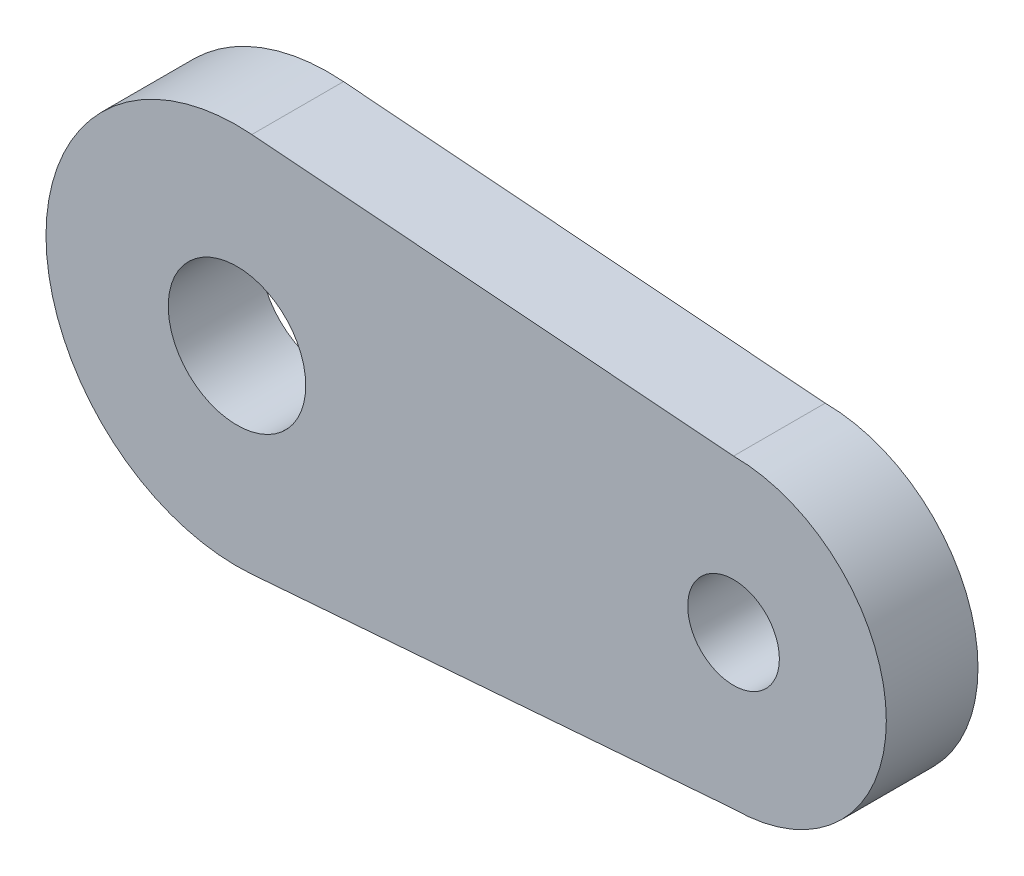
ISO-10303-21;
HEADER;
FILE_DESCRIPTION(('STEP AP214'),'2;1');
FILE_NAME('part.step','',(''),(''),'','','');
FILE_SCHEMA(('AUTOMOTIVE_DESIGN { 1 0 10303 214 1 1 1 1 }'));
ENDSEC;
DATA;
#1=APPLICATION_CONTEXT('core data for automotive mechanical design processes');
#2=APPLICATION_PROTOCOL_DEFINITION('international standard','automotive_design',2000,#1);
#3=PRODUCT_CONTEXT('',#1,'mechanical');
#4=PRODUCT('Part','Part','',(#3));
#5=PRODUCT_RELATED_PRODUCT_CATEGORY('part','',(#4));
#6=PRODUCT_DEFINITION_FORMATION('','',#4);
#7=PRODUCT_DEFINITION_CONTEXT('part definition',#1,'design');
#8=PRODUCT_DEFINITION('design','',#6,#7);
#9=PRODUCT_DEFINITION_SHAPE('','',#8);
#10=(LENGTH_UNIT() NAMED_UNIT(*) SI_UNIT(.MILLI.,.METRE.));
#11=(NAMED_UNIT(*) PLANE_ANGLE_UNIT() SI_UNIT($,.RADIAN.));
#12=(NAMED_UNIT(*) SI_UNIT($,.STERADIAN.) SOLID_ANGLE_UNIT());
#13=UNCERTAINTY_MEASURE_WITH_UNIT(LENGTH_MEASURE(1.E-05),#10,'distance_accuracy_value','');
#14=(GEOMETRIC_REPRESENTATION_CONTEXT(3) GLOBAL_UNCERTAINTY_ASSIGNED_CONTEXT((#13)) GLOBAL_UNIT_ASSIGNED_CONTEXT((#10,
#11,#12)) REPRESENTATION_CONTEXT('',''));
#15=CARTESIAN_POINT('',(0.,0.,0.));
#16=DIRECTION('',(0.,0.,1.));
#17=DIRECTION('',(1.,0.,0.));
#18=AXIS2_PLACEMENT_3D('',#15,#16,#17);
#19=CARTESIAN_POINT('',(65.,0.,12.));
#20=DIRECTION('',(0.,0.,1.));
#21=DIRECTION('',(1.,0.,0.));
#22=AXIS2_PLACEMENT_3D('',#19,#20,#21);
#23=PLANE('',#22);
#24=CARTESIAN_POINT('',(0.,0.,12.));
#25=DIRECTION('',(0.,0.,1.));
#26=DIRECTION('',(1.,0.,0.));
#27=AXIS2_PLACEMENT_3D('',#24,#25,#26);
#28=CIRCLE('',#27,9.);
#29=CARTESIAN_POINT('',(9.,0.,12.));
#30=VERTEX_POINT('',#29);
#31=EDGE_CURVE('E103',#30,#30,#28,.T.);
#32=ORIENTED_EDGE('',*,*,#31,.F.);
#33=EDGE_LOOP('',(#32));
#34=FACE_BOUND('',#33,.T.);
#35=CARTESIAN_POINT('',(65.,0.,12.));
#36=DIRECTION('',(0.,0.,1.));
#37=DIRECTION('',(1.,0.,0.));
#38=AXIS2_PLACEMENT_3D('',#35,#36,#37);
#39=CIRCLE('',#38,20.);
#40=CARTESIAN_POINT('',(65.,-20.,12.));
#41=VERTEX_POINT('',#40);
#42=CARTESIAN_POINT('',(65.,20.,12.));
#43=VERTEX_POINT('',#42);
#44=EDGE_CURVE('E88',#41,#43,#39,.T.);
#45=ORIENTED_EDGE('',*,*,#44,.T.);
#46=DIRECTION('',(-0.996964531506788,0.0778570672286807,0.));
#47=VECTOR('',#46,1.);
#48=CARTESIAN_POINT('',(1.94642668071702,24.9241132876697,12.));
#49=LINE('',#48,#47);
#50=CARTESIAN_POINT('',(1.94642668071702,24.9241132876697,12.));
#51=VERTEX_POINT('',#50);
#52=EDGE_CURVE('E83',#43,#51,#49,.T.);
#53=ORIENTED_EDGE('',*,*,#52,.T.);
#54=CARTESIAN_POINT('',(0.,0.,12.));
#55=DIRECTION('',(0.,0.,1.));
#56=DIRECTION('',(1.,0.,0.));
#57=AXIS2_PLACEMENT_3D('',#54,#55,#56);
#58=CIRCLE('',#57,25.);
#59=CARTESIAN_POINT('',(1.94642668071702,-24.9241132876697,12.));
#60=VERTEX_POINT('',#59);
#61=EDGE_CURVE('E86',#51,#60,#58,.T.);
#62=ORIENTED_EDGE('',*,*,#61,.T.);
#63=DIRECTION('',(0.996964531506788,0.0778570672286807,0.));
#64=VECTOR('',#63,1.);
#65=CARTESIAN_POINT('',(1.94642668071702,-24.9241132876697,12.));
#66=LINE('',#65,#64);
#67=EDGE_CURVE('E53',#60,#41,#66,.T.);
#68=ORIENTED_EDGE('',*,*,#67,.T.);
#69=EDGE_LOOP('',(#45,#53,#62,#68));
#70=FACE_BOUND('',#69,.T.);
#71=CARTESIAN_POINT('',(65.,0.,12.));
#72=DIRECTION('',(0.,0.,1.));
#73=DIRECTION('',(1.,0.,0.));
#74=AXIS2_PLACEMENT_3D('',#71,#72,#73);
#75=CIRCLE('',#74,6.);
#76=CARTESIAN_POINT('',(71.,0.,12.));
#77=VERTEX_POINT('',#76);
#78=EDGE_CURVE('E118',#77,#77,#75,.T.);
#79=ORIENTED_EDGE('',*,*,#78,.F.);
#80=EDGE_LOOP('',(#79));
#81=FACE_BOUND('',#80,.T.);
#82=ADVANCED_FACE('F36',(#34,#70,#81),#23,.T.);
#83=CARTESIAN_POINT('',(65.,0.,0.));
#84=DIRECTION('',(0.,0.,1.));
#85=DIRECTION('',(1.,0.,0.));
#86=AXIS2_PLACEMENT_3D('',#83,#84,#85);
#87=PLANE('',#86);
#88=CARTESIAN_POINT('',(65.,0.,0.));
#89=DIRECTION('',(0.,0.,1.));
#90=DIRECTION('',(1.,0.,0.));
#91=AXIS2_PLACEMENT_3D('',#88,#89,#90);
#92=CIRCLE('',#91,20.);
#93=CARTESIAN_POINT('',(65.,-20.,0.));
#94=VERTEX_POINT('',#93);
#95=CARTESIAN_POINT('',(65.,20.,0.));
#96=VERTEX_POINT('',#95);
#97=EDGE_CURVE('E100',#94,#96,#92,.T.);
#98=ORIENTED_EDGE('',*,*,#97,.F.);
#99=DIRECTION('',(0.996964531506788,0.0778570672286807,0.));
#100=VECTOR('',#99,1.);
#101=CARTESIAN_POINT('',(1.94642668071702,-24.9241132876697,0.));
#102=LINE('',#101,#100);
#103=CARTESIAN_POINT('',(1.94642668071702,-24.9241132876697,0.));
#104=VERTEX_POINT('',#103);
#105=EDGE_CURVE('E76',#104,#94,#102,.T.);
#106=ORIENTED_EDGE('',*,*,#105,.F.);
#107=CARTESIAN_POINT('',(0.,0.,0.));
#108=DIRECTION('',(0.,0.,1.));
#109=DIRECTION('',(1.,0.,0.));
#110=AXIS2_PLACEMENT_3D('',#107,#108,#109);
#111=CIRCLE('',#110,25.);
#112=CARTESIAN_POINT('',(1.94642668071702,24.9241132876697,0.));
#113=VERTEX_POINT('',#112);
#114=EDGE_CURVE('E70',#113,#104,#111,.T.);
#115=ORIENTED_EDGE('',*,*,#114,.F.);
#116=DIRECTION('',(-0.996964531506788,0.0778570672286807,0.));
#117=VECTOR('',#116,1.);
#118=CARTESIAN_POINT('',(1.94642668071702,24.9241132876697,0.));
#119=LINE('',#118,#117);
#120=EDGE_CURVE('E92',#96,#113,#119,.T.);
#121=ORIENTED_EDGE('',*,*,#120,.F.);
#122=EDGE_LOOP('',(#98,#106,#115,#121));
#123=FACE_BOUND('',#122,.T.);
#124=CARTESIAN_POINT('',(0.,0.,0.));
#125=DIRECTION('',(0.,0.,1.));
#126=DIRECTION('',(1.,0.,0.));
#127=AXIS2_PLACEMENT_3D('',#124,#125,#126);
#128=CIRCLE('',#127,9.);
#129=CARTESIAN_POINT('',(9.,0.,0.));
#130=VERTEX_POINT('',#129);
#131=EDGE_CURVE('E115',#130,#130,#128,.T.);
#132=ORIENTED_EDGE('',*,*,#131,.T.);
#133=EDGE_LOOP('',(#132));
#134=FACE_BOUND('',#133,.T.);
#135=CARTESIAN_POINT('',(65.,0.,0.));
#136=DIRECTION('',(0.,0.,1.));
#137=DIRECTION('',(1.,0.,0.));
#138=AXIS2_PLACEMENT_3D('',#135,#136,#137);
#139=CIRCLE('',#138,6.);
#140=CARTESIAN_POINT('',(71.,0.,0.));
#141=VERTEX_POINT('',#140);
#142=EDGE_CURVE('E121',#141,#141,#139,.T.);
#143=ORIENTED_EDGE('',*,*,#142,.T.);
#144=EDGE_LOOP('',(#143));
#145=FACE_BOUND('',#144,.T.);
#146=ADVANCED_FACE('F111',(#123,#134,#145),#87,.F.);
#147=CARTESIAN_POINT('',(65.,0.,12.));
#148=DIRECTION('',(0.,0.,-1.));
#149=DIRECTION('',(-1.,0.,0.));
#150=AXIS2_PLACEMENT_3D('',#147,#148,#149);
#151=CYLINDRICAL_SURFACE('',#150,20.);
#152=ORIENTED_EDGE('',*,*,#97,.T.);
#153=DIRECTION('',(0.,0.,-1.));
#154=VECTOR('',#153,1.);
#155=CARTESIAN_POINT('',(65.,20.,12.));
#156=LINE('',#155,#154);
#157=EDGE_CURVE('E11',#43,#96,#156,.T.);
#158=ORIENTED_EDGE('',*,*,#157,.F.);
#159=ORIENTED_EDGE('',*,*,#44,.F.);
#160=DIRECTION('',(0.,0.,-1.));
#161=VECTOR('',#160,1.);
#162=CARTESIAN_POINT('',(65.,-20.,12.));
#163=LINE('',#162,#161);
#164=EDGE_CURVE('E96',#41,#94,#163,.T.);
#165=ORIENTED_EDGE('',*,*,#164,.T.);
#166=EDGE_LOOP('',(#152,#158,#159,#165));
#167=FACE_BOUND('',#166,.T.);
#168=ADVANCED_FACE('F38',(#167),#151,.T.);
#169=CARTESIAN_POINT('',(1.94642668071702,24.9241132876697,12.));
#170=DIRECTION('',(-0.0778570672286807,-0.996964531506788,0.));
#171=DIRECTION('',(0.996964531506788,-0.0778570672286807,0.));
#172=AXIS2_PLACEMENT_3D('',#169,#170,#171);
#173=PLANE('',#172);
#174=ORIENTED_EDGE('',*,*,#120,.T.);
#175=DIRECTION('',(0.,0.,-1.));
#176=VECTOR('',#175,1.);
#177=CARTESIAN_POINT('',(1.94642668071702,24.9241132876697,12.));
#178=LINE('',#177,#176);
#179=EDGE_CURVE('E45',#51,#113,#178,.T.);
#180=ORIENTED_EDGE('',*,*,#179,.F.);
#181=ORIENTED_EDGE('',*,*,#52,.F.);
#182=ORIENTED_EDGE('',*,*,#157,.T.);
#183=EDGE_LOOP('',(#174,#180,#181,#182));
#184=FACE_BOUND('',#183,.T.);
#185=ADVANCED_FACE('F91',(#184),#173,.F.);
#186=CARTESIAN_POINT('',(0.,0.,12.));
#187=DIRECTION('',(0.,0.,-1.));
#188=DIRECTION('',(-1.,0.,0.));
#189=AXIS2_PLACEMENT_3D('',#186,#187,#188);
#190=CYLINDRICAL_SURFACE('',#189,25.);
#191=ORIENTED_EDGE('',*,*,#114,.T.);
#192=DIRECTION('',(0.,0.,-1.));
#193=VECTOR('',#192,1.);
#194=CARTESIAN_POINT('',(1.94642668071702,-24.9241132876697,12.));
#195=LINE('',#194,#193);
#196=EDGE_CURVE('E93',#60,#104,#195,.T.);
#197=ORIENTED_EDGE('',*,*,#196,.F.);
#198=ORIENTED_EDGE('',*,*,#61,.F.);
#199=ORIENTED_EDGE('',*,*,#179,.T.);
#200=EDGE_LOOP('',(#191,#197,#198,#199));
#201=FACE_BOUND('',#200,.T.);
#202=ADVANCED_FACE('F94',(#201),#190,.T.);
#203=CARTESIAN_POINT('',(1.94642668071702,-24.9241132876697,12.));
#204=DIRECTION('',(-0.0778570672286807,0.996964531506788,0.));
#205=DIRECTION('',(-0.996964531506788,-0.0778570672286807,0.));
#206=AXIS2_PLACEMENT_3D('',#203,#204,#205);
#207=PLANE('',#206);
#208=ORIENTED_EDGE('',*,*,#105,.T.);
#209=ORIENTED_EDGE('',*,*,#164,.F.);
#210=ORIENTED_EDGE('',*,*,#67,.F.);
#211=ORIENTED_EDGE('',*,*,#196,.T.);
#212=EDGE_LOOP('',(#208,#209,#210,#211));
#213=FACE_BOUND('',#212,.T.);
#214=ADVANCED_FACE('F108',(#213),#207,.F.);
#215=CARTESIAN_POINT('',(0.,0.,12.));
#216=DIRECTION('',(0.,0.,-1.));
#217=DIRECTION('',(-1.,0.,0.));
#218=AXIS2_PLACEMENT_3D('',#215,#216,#217);
#219=CYLINDRICAL_SURFACE('',#218,9.);
#220=ORIENTED_EDGE('',*,*,#31,.T.);
#221=EDGE_LOOP('',(#220));
#222=FACE_BOUND('',#221,.T.);
#223=ORIENTED_EDGE('',*,*,#131,.F.);
#224=EDGE_LOOP('',(#223));
#225=FACE_BOUND('',#224,.T.);
#226=ADVANCED_FACE('F138',(#222,#225),#219,.F.);
#227=CARTESIAN_POINT('',(65.,0.,12.));
#228=DIRECTION('',(0.,0.,-1.));
#229=DIRECTION('',(-1.,0.,0.));
#230=AXIS2_PLACEMENT_3D('',#227,#228,#229);
#231=CYLINDRICAL_SURFACE('',#230,6.);
#232=ORIENTED_EDGE('',*,*,#78,.T.);
#233=EDGE_LOOP('',(#232));
#234=FACE_BOUND('',#233,.T.);
#235=ORIENTED_EDGE('',*,*,#142,.F.);
#236=EDGE_LOOP('',(#235));
#237=FACE_BOUND('',#236,.T.);
#238=ADVANCED_FACE('F127',(#234,#237),#231,.F.);
#239=CLOSED_SHELL('',(#82,#146,#168,#185,#202,#214,#226,#238));
#240=MANIFOLD_SOLID_BREP('B2',#239);
#241=ADVANCED_BREP_SHAPE_REPRESENTATION('',(#18,#240),#14);
#242=SHAPE_DEFINITION_REPRESENTATION(#9,#241);
ENDSEC;
END-ISO-10303-21;
